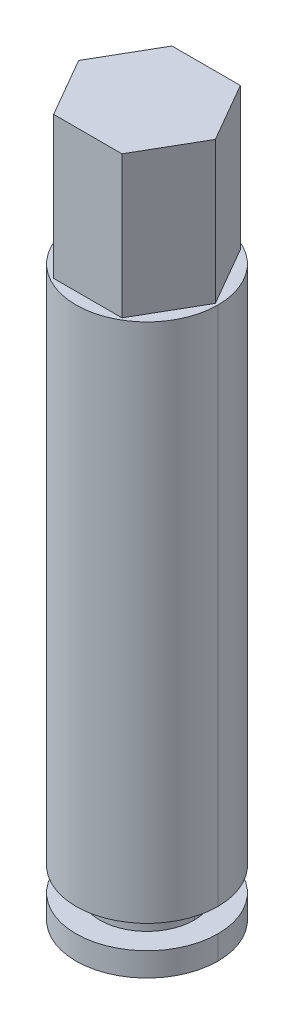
ISO-10303-21;
HEADER;
FILE_DESCRIPTION(('STEP AP214'),'2;1');
FILE_NAME('part.step','',(''),(''),'','','');
FILE_SCHEMA(('AUTOMOTIVE_DESIGN { 1 0 10303 214 1 1 1 1 }'));
ENDSEC;
DATA;
#1=APPLICATION_CONTEXT('core data for automotive mechanical design processes');
#2=APPLICATION_PROTOCOL_DEFINITION('international standard','automotive_design',2000,#1);
#3=PRODUCT_CONTEXT('',#1,'mechanical');
#4=PRODUCT('Part','Part','',(#3));
#5=PRODUCT_RELATED_PRODUCT_CATEGORY('part','',(#4));
#6=PRODUCT_DEFINITION_FORMATION('','',#4);
#7=PRODUCT_DEFINITION_CONTEXT('part definition',#1,'design');
#8=PRODUCT_DEFINITION('design','',#6,#7);
#9=PRODUCT_DEFINITION_SHAPE('','',#8);
#10=(LENGTH_UNIT() NAMED_UNIT(*) SI_UNIT(.MILLI.,.METRE.));
#11=(NAMED_UNIT(*) PLANE_ANGLE_UNIT() SI_UNIT($,.RADIAN.));
#12=(NAMED_UNIT(*) SI_UNIT($,.STERADIAN.) SOLID_ANGLE_UNIT());
#13=UNCERTAINTY_MEASURE_WITH_UNIT(LENGTH_MEASURE(1.E-05),#10,'distance_accuracy_value','');
#14=(GEOMETRIC_REPRESENTATION_CONTEXT(3) GLOBAL_UNCERTAINTY_ASSIGNED_CONTEXT((#13)) GLOBAL_UNIT_ASSIGNED_CONTEXT((#10,
#11,#12)) REPRESENTATION_CONTEXT('',''));
#15=CARTESIAN_POINT('',(0.,0.,0.));
#16=DIRECTION('',(0.,0.,1.));
#17=DIRECTION('',(1.,0.,0.));
#18=AXIS2_PLACEMENT_3D('',#15,#16,#17);
#19=CARTESIAN_POINT('',(0.,-47.625,0.));
#20=DIRECTION('',(0.,-1.,0.));
#21=DIRECTION('',(1.,0.,0.));
#22=AXIS2_PLACEMENT_3D('',#19,#20,#21);
#23=PLANE('',#22);
#24=CARTESIAN_POINT('',(0.,-47.625,0.));
#25=DIRECTION('',(0.,1.,0.));
#26=DIRECTION('',(-1.,0.,0.));
#27=AXIS2_PLACEMENT_3D('',#24,#25,#26);
#28=CIRCLE('',#27,9.525);
#29=CARTESIAN_POINT('',(9.52499999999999,-47.625,0.));
#30=VERTEX_POINT('',#29);
#31=CARTESIAN_POINT('',(-9.52500000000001,-47.625,0.));
#32=VERTEX_POINT('',#31);
#33=EDGE_CURVE('E80',#30,#32,#28,.T.);
#34=ORIENTED_EDGE('',*,*,#33,.F.);
#35=CARTESIAN_POINT('',(0.,-47.625,0.));
#36=DIRECTION('',(0.,1.,0.));
#37=DIRECTION('',(-1.,0.,0.));
#38=AXIS2_PLACEMENT_3D('',#35,#36,#37);
#39=CIRCLE('',#38,9.525);
#40=EDGE_CURVE('E19',#32,#30,#39,.T.);
#41=ORIENTED_EDGE('',*,*,#40,.F.);
#42=EDGE_LOOP('',(#34,#41));
#43=FACE_BOUND('',#42,.T.);
#44=ADVANCED_FACE('F16',(#43),#23,.T.);
#45=CARTESIAN_POINT('',(0.,-34.925,0.));
#46=DIRECTION('',(0.,1.,0.));
#47=DIRECTION('',(-1.,0.,0.));
#48=AXIS2_PLACEMENT_3D('',#45,#46,#47);
#49=CYLINDRICAL_SURFACE('',#48,9.525);
#50=DIRECTION('',(0.,1.,0.));
#51=VECTOR('',#50,1.);
#52=CARTESIAN_POINT('',(9.52499999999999,-34.925,0.));
#53=LINE('',#52,#51);
#54=CARTESIAN_POINT('',(9.52499999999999,-44.45,0.));
#55=VERTEX_POINT('',#54);
#56=EDGE_CURVE('E75',#55,#30,#53,.F.);
#57=ORIENTED_EDGE('',*,*,#56,.F.);
#58=CARTESIAN_POINT('',(0.,-44.45,0.));
#59=DIRECTION('',(0.,1.,0.));
#60=DIRECTION('',(-1.,0.,0.));
#61=AXIS2_PLACEMENT_3D('',#58,#59,#60);
#62=CIRCLE('',#61,9.525);
#63=CARTESIAN_POINT('',(-9.52500000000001,-44.45,0.));
#64=VERTEX_POINT('',#63);
#65=EDGE_CURVE('E82',#55,#64,#62,.F.);
#66=ORIENTED_EDGE('',*,*,#65,.T.);
#67=DIRECTION('',(0.,1.,0.));
#68=VECTOR('',#67,1.);
#69=CARTESIAN_POINT('',(-9.52500000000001,-34.925,0.));
#70=LINE('',#69,#68);
#71=EDGE_CURVE('E78',#32,#64,#70,.T.);
#72=ORIENTED_EDGE('',*,*,#71,.F.);
#73=ORIENTED_EDGE('',*,*,#40,.T.);
#74=EDGE_LOOP('',(#57,#66,#72,#73));
#75=FACE_BOUND('',#74,.T.);
#76=ADVANCED_FACE('F73',(#75),#49,.T.);
#77=CARTESIAN_POINT('',(0.,-34.925,0.));
#78=DIRECTION('',(0.,1.,0.));
#79=DIRECTION('',(-1.,0.,0.));
#80=AXIS2_PLACEMENT_3D('',#77,#78,#79);
#81=CYLINDRICAL_SURFACE('',#80,9.525);
#82=ORIENTED_EDGE('',*,*,#56,.T.);
#83=ORIENTED_EDGE('',*,*,#33,.T.);
#84=ORIENTED_EDGE('',*,*,#71,.T.);
#85=CARTESIAN_POINT('',(0.,-44.45,0.));
#86=DIRECTION('',(0.,1.,0.));
#87=DIRECTION('',(-1.,0.,0.));
#88=AXIS2_PLACEMENT_3D('',#85,#86,#87);
#89=CIRCLE('',#88,9.525);
#90=EDGE_CURVE('E85',#64,#55,#89,.F.);
#91=ORIENTED_EDGE('',*,*,#90,.T.);
#92=EDGE_LOOP('',(#82,#83,#84,#91));
#93=FACE_BOUND('',#92,.T.);
#94=ADVANCED_FACE('F83',(#93),#81,.T.);
#95=CARTESIAN_POINT('',(4.58271776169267,47.625,7.9375));
#96=DIRECTION('',(0.,-1.,0.));
#97=DIRECTION('',(1.,0.,0.));
#98=AXIS2_PLACEMENT_3D('',#95,#96,#97);
#99=PLANE('',#98);
#100=DIRECTION('',(0.500000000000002,0.,-0.866025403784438));
#101=VECTOR('',#100,1.);
#102=CARTESIAN_POINT('',(9.16543552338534,47.625,0.));
#103=LINE('',#102,#101);
#104=CARTESIAN_POINT('',(9.16543552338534,47.625,0.));
#105=VERTEX_POINT('',#104);
#106=CARTESIAN_POINT('',(4.58271776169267,47.625,7.9375));
#107=VERTEX_POINT('',#106);
#108=EDGE_CURVE('E140',#105,#107,#103,.F.);
#109=ORIENTED_EDGE('',*,*,#108,.F.);
#110=DIRECTION('',(-0.500000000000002,0.,-0.866025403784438));
#111=VECTOR('',#110,1.);
#112=CARTESIAN_POINT('',(4.58271776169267,47.625,-7.9375));
#113=LINE('',#112,#111);
#114=CARTESIAN_POINT('',(4.58271776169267,47.625,-7.9375));
#115=VERTEX_POINT('',#114);
#116=EDGE_CURVE('E146',#115,#105,#113,.F.);
#117=ORIENTED_EDGE('',*,*,#116,.F.);
#118=DIRECTION('',(-1.,0.,0.));
#119=VECTOR('',#118,1.);
#120=CARTESIAN_POINT('',(-4.58271776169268,47.625,-7.9375));
#121=LINE('',#120,#119);
#122=CARTESIAN_POINT('',(-4.58271776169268,47.625,-7.9375));
#123=VERTEX_POINT('',#122);
#124=EDGE_CURVE('E152',#123,#115,#121,.F.);
#125=ORIENTED_EDGE('',*,*,#124,.F.);
#126=DIRECTION('',(-0.500000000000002,0.,0.866025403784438));
#127=VECTOR('',#126,1.);
#128=CARTESIAN_POINT('',(-9.16543552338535,47.625,0.));
#129=LINE('',#128,#127);
#130=CARTESIAN_POINT('',(-9.16543552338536,47.625,0.));
#131=VERTEX_POINT('',#130);
#132=EDGE_CURVE('E158',#131,#123,#129,.F.);
#133=ORIENTED_EDGE('',*,*,#132,.F.);
#134=DIRECTION('',(0.500000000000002,0.,0.866025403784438));
#135=VECTOR('',#134,1.);
#136=CARTESIAN_POINT('',(-4.58271776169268,47.625,7.9375));
#137=LINE('',#136,#135);
#138=CARTESIAN_POINT('',(-4.58271776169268,47.625,7.9375));
#139=VERTEX_POINT('',#138);
#140=EDGE_CURVE('E164',#139,#131,#137,.F.);
#141=ORIENTED_EDGE('',*,*,#140,.F.);
#142=DIRECTION('',(1.,0.,0.));
#143=VECTOR('',#142,1.);
#144=CARTESIAN_POINT('',(4.58271776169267,47.625,7.9375));
#145=LINE('',#144,#143);
#146=EDGE_CURVE('E114',#107,#139,#145,.F.);
#147=ORIENTED_EDGE('',*,*,#146,.F.);
#148=EDGE_LOOP('',(#109,#117,#125,#133,#141,#147));
#149=FACE_BOUND('',#148,.T.);
#150=ADVANCED_FACE('F120',(#149),#99,.F.);
#151=CARTESIAN_POINT('',(0.,-44.45,0.));
#152=DIRECTION('',(0.,-1.,0.));
#153=DIRECTION('',(1.,0.,0.));
#154=AXIS2_PLACEMENT_3D('',#151,#152,#153);
#155=PLANE('',#154);
#156=ORIENTED_EDGE('',*,*,#65,.F.);
#157=ORIENTED_EDGE('',*,*,#90,.F.);
#158=EDGE_LOOP('',(#156,#157));
#159=FACE_BOUND('',#158,.T.);
#160=CARTESIAN_POINT('',(0.,-44.45,0.));
#161=DIRECTION('',(0.,1.,0.));
#162=DIRECTION('',(-1.,0.,0.));
#163=AXIS2_PLACEMENT_3D('',#160,#161,#162);
#164=CIRCLE('',#163,6.35);
#165=CARTESIAN_POINT('',(6.34999999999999,-44.45,0.));
#166=VERTEX_POINT('',#165);
#167=CARTESIAN_POINT('',(-6.35000000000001,-44.45,0.));
#168=VERTEX_POINT('',#167);
#169=EDGE_CURVE('E104',#166,#168,#164,.T.);
#170=ORIENTED_EDGE('',*,*,#169,.F.);
#171=CARTESIAN_POINT('',(0.,-44.45,0.));
#172=DIRECTION('',(0.,1.,0.));
#173=DIRECTION('',(-1.,0.,0.));
#174=AXIS2_PLACEMENT_3D('',#171,#172,#173);
#175=CIRCLE('',#174,6.35);
#176=EDGE_CURVE('E109',#168,#166,#175,.T.);
#177=ORIENTED_EDGE('',*,*,#176,.F.);
#178=EDGE_LOOP('',(#170,#177));
#179=FACE_BOUND('',#178,.T.);
#180=ADVANCED_FACE('F116',(#159,#179),#155,.F.);
#181=CARTESIAN_POINT('',(4.58271776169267,28.575,7.9375));
#182=DIRECTION('',(0.,0.,1.));
#183=DIRECTION('',(1.,0.,0.));
#184=AXIS2_PLACEMENT_3D('',#181,#182,#183);
#185=PLANE('',#184);
#186=DIRECTION('',(1.,0.,0.));
#187=VECTOR('',#186,1.);
#188=CARTESIAN_POINT('',(0.,28.575,7.9375));
#189=LINE('',#188,#187);
#190=CARTESIAN_POINT('',(4.58271776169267,28.575,7.9375));
#191=VERTEX_POINT('',#190);
#192=CARTESIAN_POINT('',(-4.58271776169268,28.575,7.9375));
#193=VERTEX_POINT('',#192);
#194=EDGE_CURVE('E107',#191,#193,#189,.F.);
#195=ORIENTED_EDGE('',*,*,#194,.F.);
#196=DIRECTION('',(0.,1.,0.));
#197=VECTOR('',#196,1.);
#198=CARTESIAN_POINT('',(4.58271776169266,28.575,7.9375));
#199=LINE('',#198,#197);
#200=EDGE_CURVE('E137',#107,#191,#199,.F.);
#201=ORIENTED_EDGE('',*,*,#200,.F.);
#202=ORIENTED_EDGE('',*,*,#146,.T.);
#203=DIRECTION('',(0.,1.,0.));
#204=VECTOR('',#203,1.);
#205=CARTESIAN_POINT('',(-4.58271776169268,28.575,7.9375));
#206=LINE('',#205,#204);
#207=EDGE_CURVE('E161',#193,#139,#206,.T.);
#208=ORIENTED_EDGE('',*,*,#207,.F.);
#209=EDGE_LOOP('',(#195,#201,#202,#208));
#210=FACE_BOUND('',#209,.T.);
#211=ADVANCED_FACE('F119',(#210),#185,.T.);
#212=CARTESIAN_POINT('',(-4.58271776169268,28.575,7.9375));
#213=DIRECTION('',(-0.866025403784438,0.,0.500000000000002));
#214=DIRECTION('',(0.500000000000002,0.,0.866025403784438));
#215=AXIS2_PLACEMENT_3D('',#212,#213,#214);
#216=PLANE('',#215);
#217=DIRECTION('',(-0.500000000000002,0.,-0.866025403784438));
#218=VECTOR('',#217,1.);
#219=CARTESIAN_POINT('',(-4.58271776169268,28.575,7.9375));
#220=LINE('',#219,#218);
#221=CARTESIAN_POINT('',(-9.16543552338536,28.575,0.));
#222=VERTEX_POINT('',#221);
#223=EDGE_CURVE('E182',#193,#222,#220,.T.);
#224=ORIENTED_EDGE('',*,*,#223,.F.);
#225=ORIENTED_EDGE('',*,*,#207,.T.);
#226=ORIENTED_EDGE('',*,*,#140,.T.);
#227=DIRECTION('',(0.,1.,0.));
#228=VECTOR('',#227,1.);
#229=CARTESIAN_POINT('',(-9.16543552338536,28.575,0.));
#230=LINE('',#229,#228);
#231=EDGE_CURVE('E155',#222,#131,#230,.T.);
#232=ORIENTED_EDGE('',*,*,#231,.F.);
#233=EDGE_LOOP('',(#224,#225,#226,#232));
#234=FACE_BOUND('',#233,.T.);
#235=ADVANCED_FACE('F179',(#234),#216,.T.);
#236=CARTESIAN_POINT('',(-9.16543552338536,28.575,0.));
#237=DIRECTION('',(-0.866025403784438,0.,-0.500000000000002));
#238=DIRECTION('',(-0.500000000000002,0.,0.866025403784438));
#239=AXIS2_PLACEMENT_3D('',#236,#237,#238);
#240=PLANE('',#239);
#241=DIRECTION('',(0.500000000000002,0.,-0.866025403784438));
#242=VECTOR('',#241,1.);
#243=CARTESIAN_POINT('',(-9.16543552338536,28.575,0.));
#244=LINE('',#243,#242);
#245=CARTESIAN_POINT('',(-4.58271776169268,28.575,-7.9375));
#246=VERTEX_POINT('',#245);
#247=EDGE_CURVE('E189',#222,#246,#244,.T.);
#248=ORIENTED_EDGE('',*,*,#247,.F.);
#249=ORIENTED_EDGE('',*,*,#231,.T.);
#250=ORIENTED_EDGE('',*,*,#132,.T.);
#251=DIRECTION('',(0.,1.,0.));
#252=VECTOR('',#251,1.);
#253=CARTESIAN_POINT('',(-4.58271776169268,28.575,-7.9375));
#254=LINE('',#253,#252);
#255=EDGE_CURVE('E149',#246,#123,#254,.T.);
#256=ORIENTED_EDGE('',*,*,#255,.F.);
#257=EDGE_LOOP('',(#248,#249,#250,#256));
#258=FACE_BOUND('',#257,.T.);
#259=ADVANCED_FACE('F248',(#258),#240,.T.);
#260=CARTESIAN_POINT('',(-4.58271776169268,28.575,-7.9375));
#261=DIRECTION('',(0.,0.,-1.));
#262=DIRECTION('',(-1.,0.,0.));
#263=AXIS2_PLACEMENT_3D('',#260,#261,#262);
#264=PLANE('',#263);
#265=DIRECTION('',(1.,0.,0.));
#266=VECTOR('',#265,1.);
#267=CARTESIAN_POINT('',(0.,28.575,-7.9375));
#268=LINE('',#267,#266);
#269=CARTESIAN_POINT('',(4.58271776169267,28.575,-7.9375));
#270=VERTEX_POINT('',#269);
#271=EDGE_CURVE('E197',#246,#270,#268,.T.);
#272=ORIENTED_EDGE('',*,*,#271,.F.);
#273=ORIENTED_EDGE('',*,*,#255,.T.);
#274=ORIENTED_EDGE('',*,*,#124,.T.);
#275=DIRECTION('',(0.,1.,0.));
#276=VECTOR('',#275,1.);
#277=CARTESIAN_POINT('',(4.58271776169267,28.575,-7.9375));
#278=LINE('',#277,#276);
#279=EDGE_CURVE('E143',#270,#115,#278,.T.);
#280=ORIENTED_EDGE('',*,*,#279,.F.);
#281=EDGE_LOOP('',(#272,#273,#274,#280));
#282=FACE_BOUND('',#281,.T.);
#283=ADVANCED_FACE('F244',(#282),#264,.T.);
#284=CARTESIAN_POINT('',(4.58271776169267,28.575,-7.9375));
#285=DIRECTION('',(0.866025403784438,0.,-0.500000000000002));
#286=DIRECTION('',(-0.500000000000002,0.,-0.866025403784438));
#287=AXIS2_PLACEMENT_3D('',#284,#285,#286);
#288=PLANE('',#287);
#289=DIRECTION('',(0.500000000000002,0.,0.866025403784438));
#290=VECTOR('',#289,1.);
#291=CARTESIAN_POINT('',(4.58271776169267,28.575,-7.9375));
#292=LINE('',#291,#290);
#293=CARTESIAN_POINT('',(9.16543552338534,28.575,0.));
#294=VERTEX_POINT('',#293);
#295=EDGE_CURVE('E200',#270,#294,#292,.T.);
#296=ORIENTED_EDGE('',*,*,#295,.F.);
#297=ORIENTED_EDGE('',*,*,#279,.T.);
#298=ORIENTED_EDGE('',*,*,#116,.T.);
#299=DIRECTION('',(0.,1.,0.));
#300=VECTOR('',#299,1.);
#301=CARTESIAN_POINT('',(9.16543552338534,28.575,0.));
#302=LINE('',#301,#300);
#303=EDGE_CURVE('E112',#294,#105,#302,.T.);
#304=ORIENTED_EDGE('',*,*,#303,.F.);
#305=EDGE_LOOP('',(#296,#297,#298,#304));
#306=FACE_BOUND('',#305,.T.);
#307=ADVANCED_FACE('F238',(#306),#288,.T.);
#308=CARTESIAN_POINT('',(9.16543552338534,28.575,0.));
#309=DIRECTION('',(0.866025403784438,0.,0.500000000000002));
#310=DIRECTION('',(0.500000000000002,0.,-0.866025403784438));
#311=AXIS2_PLACEMENT_3D('',#308,#309,#310);
#312=PLANE('',#311);
#313=DIRECTION('',(-0.500000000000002,0.,0.866025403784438));
#314=VECTOR('',#313,1.);
#315=CARTESIAN_POINT('',(9.16543552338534,28.575,0.));
#316=LINE('',#315,#314);
#317=EDGE_CURVE('E103',#294,#191,#316,.T.);
#318=ORIENTED_EDGE('',*,*,#317,.F.);
#319=ORIENTED_EDGE('',*,*,#303,.T.);
#320=ORIENTED_EDGE('',*,*,#108,.T.);
#321=ORIENTED_EDGE('',*,*,#200,.T.);
#322=EDGE_LOOP('',(#318,#319,#320,#321));
#323=FACE_BOUND('',#322,.T.);
#324=ADVANCED_FACE('F233',(#323),#312,.T.);
#325=CARTESIAN_POINT('',(0.,-42.8625,0.));
#326=DIRECTION('',(0.,1.,0.));
#327=DIRECTION('',(-1.,0.,0.));
#328=AXIS2_PLACEMENT_3D('',#325,#326,#327);
#329=CYLINDRICAL_SURFACE('',#328,6.35);
#330=DIRECTION('',(0.,1.,0.));
#331=VECTOR('',#330,1.);
#332=CARTESIAN_POINT('',(6.34999999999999,-42.8625,0.));
#333=LINE('',#332,#331);
#334=CARTESIAN_POINT('',(6.34999999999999,-41.275,0.));
#335=VERTEX_POINT('',#334);
#336=EDGE_CURVE('E108',#335,#166,#333,.F.);
#337=ORIENTED_EDGE('',*,*,#336,.F.);
#338=CARTESIAN_POINT('',(0.,-41.275,0.));
#339=DIRECTION('',(0.,1.,0.));
#340=DIRECTION('',(-1.,0.,0.));
#341=AXIS2_PLACEMENT_3D('',#338,#339,#340);
#342=CIRCLE('',#341,6.35);
#343=CARTESIAN_POINT('',(-6.35000000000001,-41.275,0.));
#344=VERTEX_POINT('',#343);
#345=EDGE_CURVE('E99',#335,#344,#342,.F.);
#346=ORIENTED_EDGE('',*,*,#345,.T.);
#347=DIRECTION('',(0.,1.,0.));
#348=VECTOR('',#347,1.);
#349=CARTESIAN_POINT('',(-6.35000000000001,-42.8625,0.));
#350=LINE('',#349,#348);
#351=EDGE_CURVE('E111',#168,#344,#350,.T.);
#352=ORIENTED_EDGE('',*,*,#351,.F.);
#353=ORIENTED_EDGE('',*,*,#176,.T.);
#354=EDGE_LOOP('',(#337,#346,#352,#353));
#355=FACE_BOUND('',#354,.T.);
#356=ADVANCED_FACE('F220',(#355),#329,.T.);
#357=CARTESIAN_POINT('',(0.,-42.8625,0.));
#358=DIRECTION('',(0.,1.,0.));
#359=DIRECTION('',(-1.,0.,0.));
#360=AXIS2_PLACEMENT_3D('',#357,#358,#359);
#361=CYLINDRICAL_SURFACE('',#360,6.35);
#362=ORIENTED_EDGE('',*,*,#336,.T.);
#363=ORIENTED_EDGE('',*,*,#169,.T.);
#364=ORIENTED_EDGE('',*,*,#351,.T.);
#365=CARTESIAN_POINT('',(0.,-41.275,0.));
#366=DIRECTION('',(0.,1.,0.));
#367=DIRECTION('',(-1.,0.,0.));
#368=AXIS2_PLACEMENT_3D('',#365,#366,#367);
#369=CIRCLE('',#368,6.35);
#370=EDGE_CURVE('E96',#344,#335,#369,.F.);
#371=ORIENTED_EDGE('',*,*,#370,.T.);
#372=EDGE_LOOP('',(#362,#363,#364,#371));
#373=FACE_BOUND('',#372,.T.);
#374=ADVANCED_FACE('F127',(#373),#361,.T.);
#375=CARTESIAN_POINT('',(0.,28.575,0.));
#376=DIRECTION('',(0.,1.,0.));
#377=DIRECTION('',(0.,0.,1.));
#378=AXIS2_PLACEMENT_3D('',#375,#376,#377);
#379=PLANE('',#378);
#380=CARTESIAN_POINT('',(0.,28.575,0.));
#381=DIRECTION('',(0.,1.,0.));
#382=DIRECTION('',(-1.,0.,0.));
#383=AXIS2_PLACEMENT_3D('',#380,#381,#382);
#384=CIRCLE('',#383,9.525);
#385=CARTESIAN_POINT('',(9.52500000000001,28.575,0.));
#386=VERTEX_POINT('',#385);
#387=CARTESIAN_POINT('',(-9.52499999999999,28.575,0.));
#388=VERTEX_POINT('',#387);
#389=EDGE_CURVE('E101',#386,#388,#384,.F.);
#390=ORIENTED_EDGE('',*,*,#389,.F.);
#391=CARTESIAN_POINT('',(0.,28.575,0.));
#392=DIRECTION('',(0.,1.,0.));
#393=DIRECTION('',(-1.,0.,0.));
#394=AXIS2_PLACEMENT_3D('',#391,#392,#393);
#395=CIRCLE('',#394,9.525);
#396=EDGE_CURVE('E91',#388,#386,#395,.F.);
#397=ORIENTED_EDGE('',*,*,#396,.F.);
#398=EDGE_LOOP('',(#390,#397));
#399=FACE_BOUND('',#398,.T.);
#400=ORIENTED_EDGE('',*,*,#295,.T.);
#401=ORIENTED_EDGE('',*,*,#317,.T.);
#402=ORIENTED_EDGE('',*,*,#194,.T.);
#403=ORIENTED_EDGE('',*,*,#223,.T.);
#404=ORIENTED_EDGE('',*,*,#247,.T.);
#405=ORIENTED_EDGE('',*,*,#271,.T.);
#406=EDGE_LOOP('',(#400,#401,#402,#403,#404,#405));
#407=FACE_BOUND('',#406,.T.);
#408=ADVANCED_FACE('F193',(#399,#407),#379,.T.);
#409=CARTESIAN_POINT('',(0.,-34.925,0.));
#410=DIRECTION('',(0.,1.,0.));
#411=DIRECTION('',(-1.,0.,0.));
#412=AXIS2_PLACEMENT_3D('',#409,#410,#411);
#413=CYLINDRICAL_SURFACE('',#412,9.525);
#414=DIRECTION('',(0.,1.,0.));
#415=VECTOR('',#414,1.);
#416=CARTESIAN_POINT('',(9.52499999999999,-34.925,0.));
#417=LINE('',#416,#415);
#418=CARTESIAN_POINT('',(9.52499999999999,-41.275,0.));
#419=VERTEX_POINT('',#418);
#420=EDGE_CURVE('E25',#386,#419,#417,.F.);
#421=ORIENTED_EDGE('',*,*,#420,.F.);
#422=ORIENTED_EDGE('',*,*,#389,.T.);
#423=DIRECTION('',(0.,1.,0.));
#424=VECTOR('',#423,1.);
#425=CARTESIAN_POINT('',(-9.52500000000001,-34.925,0.));
#426=LINE('',#425,#424);
#427=CARTESIAN_POINT('',(-9.52500000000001,-41.275,0.));
#428=VERTEX_POINT('',#427);
#429=EDGE_CURVE('E94',#428,#388,#426,.T.);
#430=ORIENTED_EDGE('',*,*,#429,.F.);
#431=CARTESIAN_POINT('',(0.,-41.275,0.));
#432=DIRECTION('',(0.,1.,0.));
#433=DIRECTION('',(-1.,0.,0.));
#434=AXIS2_PLACEMENT_3D('',#431,#432,#433);
#435=CIRCLE('',#434,9.525);
#436=EDGE_CURVE('E34',#428,#419,#435,.T.);
#437=ORIENTED_EDGE('',*,*,#436,.T.);
#438=EDGE_LOOP('',(#421,#422,#430,#437));
#439=FACE_BOUND('',#438,.T.);
#440=ADVANCED_FACE('F209',(#439),#413,.T.);
#441=CARTESIAN_POINT('',(0.,-41.275,0.));
#442=DIRECTION('',(0.,1.,0.));
#443=DIRECTION('',(0.,0.,1.));
#444=AXIS2_PLACEMENT_3D('',#441,#442,#443);
#445=PLANE('',#444);
#446=CARTESIAN_POINT('',(0.,-41.275,0.));
#447=DIRECTION('',(0.,1.,0.));
#448=DIRECTION('',(-1.,0.,0.));
#449=AXIS2_PLACEMENT_3D('',#446,#447,#448);
#450=CIRCLE('',#449,9.525);
#451=EDGE_CURVE('E11',#419,#428,#450,.T.);
#452=ORIENTED_EDGE('',*,*,#451,.F.);
#453=ORIENTED_EDGE('',*,*,#436,.F.);
#454=EDGE_LOOP('',(#452,#453));
#455=FACE_BOUND('',#454,.T.);
#456=ORIENTED_EDGE('',*,*,#345,.F.);
#457=ORIENTED_EDGE('',*,*,#370,.F.);
#458=EDGE_LOOP('',(#456,#457));
#459=FACE_BOUND('',#458,.T.);
#460=ADVANCED_FACE('F218',(#455,#459),#445,.F.);
#461=CARTESIAN_POINT('',(0.,-34.925,0.));
#462=DIRECTION('',(0.,1.,0.));
#463=DIRECTION('',(-1.,0.,0.));
#464=AXIS2_PLACEMENT_3D('',#461,#462,#463);
#465=CYLINDRICAL_SURFACE('',#464,9.525);
#466=ORIENTED_EDGE('',*,*,#420,.T.);
#467=ORIENTED_EDGE('',*,*,#451,.T.);
#468=ORIENTED_EDGE('',*,*,#429,.T.);
#469=ORIENTED_EDGE('',*,*,#396,.T.);
#470=EDGE_LOOP('',(#466,#467,#468,#469));
#471=FACE_BOUND('',#470,.T.);
#472=ADVANCED_FACE('F207',(#471),#465,.T.);
#473=CLOSED_SHELL('',(#44,#76,#94,#150,#180,#211,#235,#259,#283,#307,#324,#356,#374,#408,#440,
#460,#472));
#474=MANIFOLD_SOLID_BREP('B1',#473);
#475=ADVANCED_BREP_SHAPE_REPRESENTATION('',(#18,#474),#14);
#476=SHAPE_DEFINITION_REPRESENTATION(#9,#475);
ENDSEC;
END-ISO-10303-21;
